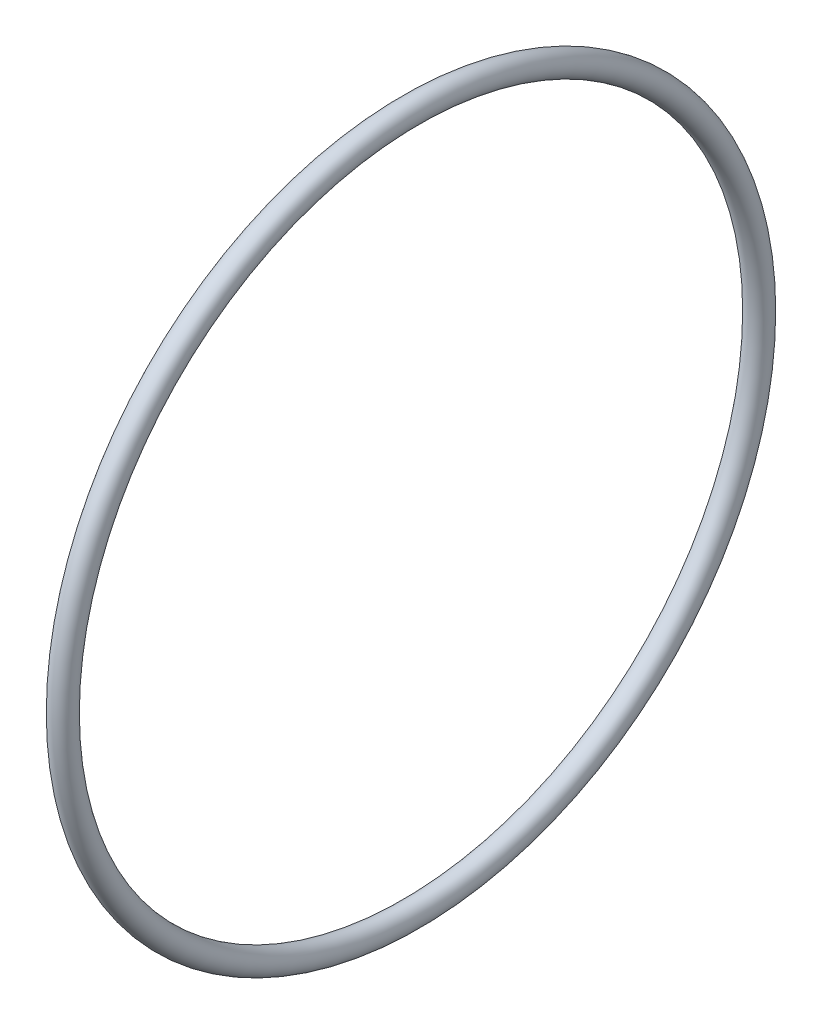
ISO-10303-21;
HEADER;
FILE_DESCRIPTION(('STEP AP214'),'2;1');
FILE_NAME('part.step','',(''),(''),'','','');
FILE_SCHEMA(('AUTOMOTIVE_DESIGN { 1 0 10303 214 1 1 1 1 }'));
ENDSEC;
DATA;
#1=APPLICATION_CONTEXT('core data for automotive mechanical design processes');
#2=APPLICATION_PROTOCOL_DEFINITION('international standard','automotive_design',2000,#1);
#3=PRODUCT_CONTEXT('',#1,'mechanical');
#4=PRODUCT('Part','Part','',(#3));
#5=PRODUCT_RELATED_PRODUCT_CATEGORY('part','',(#4));
#6=PRODUCT_DEFINITION_FORMATION('','',#4);
#7=PRODUCT_DEFINITION_CONTEXT('part definition',#1,'design');
#8=PRODUCT_DEFINITION('design','',#6,#7);
#9=PRODUCT_DEFINITION_SHAPE('','',#8);
#10=(LENGTH_UNIT() NAMED_UNIT(*) SI_UNIT(.MILLI.,.METRE.));
#11=(NAMED_UNIT(*) PLANE_ANGLE_UNIT() SI_UNIT($,.RADIAN.));
#12=(NAMED_UNIT(*) SI_UNIT($,.STERADIAN.) SOLID_ANGLE_UNIT());
#13=UNCERTAINTY_MEASURE_WITH_UNIT(LENGTH_MEASURE(1.E-05),#10,'distance_accuracy_value','');
#14=(GEOMETRIC_REPRESENTATION_CONTEXT(3) GLOBAL_UNCERTAINTY_ASSIGNED_CONTEXT((#13)) GLOBAL_UNIT_ASSIGNED_CONTEXT((#10,
#11,#12)) REPRESENTATION_CONTEXT('',''));
#15=CARTESIAN_POINT('',(0.,0.,0.));
#16=DIRECTION('',(0.,0.,1.));
#17=DIRECTION('',(1.,0.,0.));
#18=AXIS2_PLACEMENT_3D('',#15,#16,#17);
#19=CARTESIAN_POINT('',(0.,0.,0.));
#20=DIRECTION('',(1.,0.,0.));
#21=DIRECTION('',(0.,0.,-1.));
#22=AXIS2_PLACEMENT_3D('',#19,#20,#21);
#23=TOROIDAL_SURFACE('',#22,52.5653,1.7653);
#24=CARTESIAN_POINT('',(0.,0.,-54.3306));
#25=VERTEX_POINT('',#24);
#26=VERTEX_LOOP('',#25);
#27=FACE_BOUND('',#26,.T.);
#28=ADVANCED_FACE('F32',(#27),#23,.T.);
#29=CLOSED_SHELL('',(#28));
#30=MANIFOLD_SOLID_BREP('B2',#29);
#31=ADVANCED_BREP_SHAPE_REPRESENTATION('',(#18,#30),#14);
#32=SHAPE_DEFINITION_REPRESENTATION(#9,#31);
ENDSEC;
END-ISO-10303-21;
